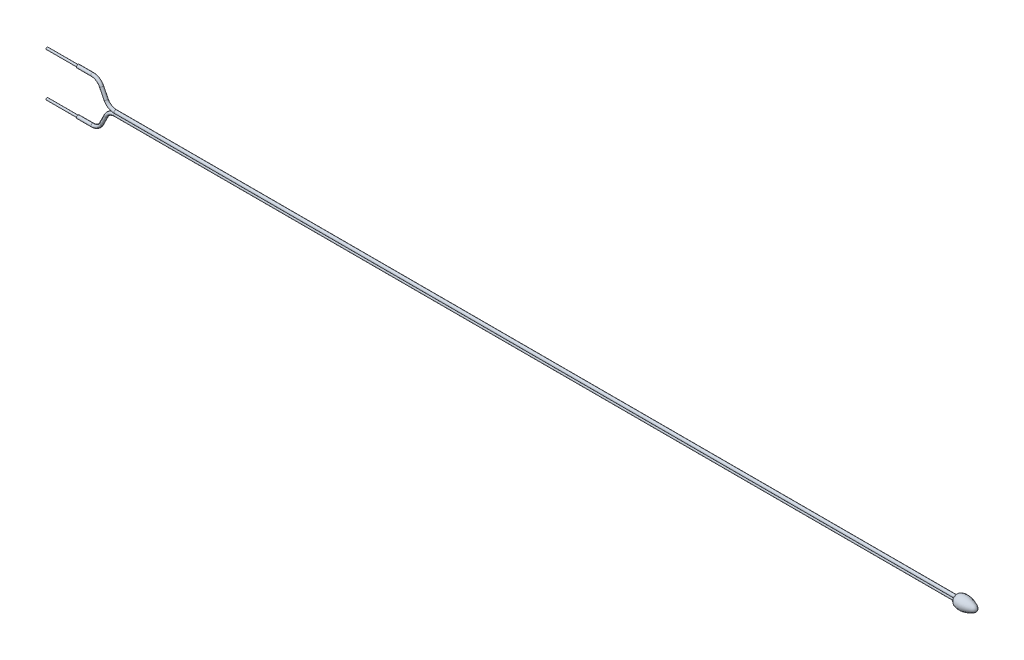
ISO-10303-21;
HEADER;
FILE_DESCRIPTION(('STEP AP214'),'2;1');
FILE_NAME('part.step','',(''),(''),'','','');
FILE_SCHEMA(('AUTOMOTIVE_DESIGN { 1 0 10303 214 1 1 1 1 }'));
ENDSEC;
DATA;
#1=APPLICATION_CONTEXT('core data for automotive mechanical design processes');
#2=APPLICATION_PROTOCOL_DEFINITION('international standard','automotive_design',2000,#1);
#3=PRODUCT_CONTEXT('',#1,'mechanical');
#4=PRODUCT('Part','Part','',(#3));
#5=PRODUCT_RELATED_PRODUCT_CATEGORY('part','',(#4));
#6=PRODUCT_DEFINITION_FORMATION('','',#4);
#7=PRODUCT_DEFINITION_CONTEXT('part definition',#1,'design');
#8=PRODUCT_DEFINITION('design','',#6,#7);
#9=PRODUCT_DEFINITION_SHAPE('','',#8);
#10=(LENGTH_UNIT() NAMED_UNIT(*) SI_UNIT(.MILLI.,.METRE.));
#11=(NAMED_UNIT(*) PLANE_ANGLE_UNIT() SI_UNIT($,.RADIAN.));
#12=(NAMED_UNIT(*) SI_UNIT($,.STERADIAN.) SOLID_ANGLE_UNIT());
#13=UNCERTAINTY_MEASURE_WITH_UNIT(LENGTH_MEASURE(1.E-05),#10,'distance_accuracy_value','');
#14=(GEOMETRIC_REPRESENTATION_CONTEXT(3) GLOBAL_UNCERTAINTY_ASSIGNED_CONTEXT((#13)) GLOBAL_UNIT_ASSIGNED_CONTEXT((#10,
#11,#12)) REPRESENTATION_CONTEXT('',''));
#15=CARTESIAN_POINT('',(0.,0.,0.));
#16=DIRECTION('',(0.,0.,1.));
#17=DIRECTION('',(1.,0.,0.));
#18=AXIS2_PLACEMENT_3D('',#15,#16,#17);
#19=CARTESIAN_POINT('',(-83.6180339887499,-2.11999999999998,0.));
#20=DIRECTION('',(-1.,0.,0.));
#21=DIRECTION('',(0.,-1.,0.));
#22=AXIS2_PLACEMENT_3D('',#19,#20,#21);
#23=CYLINDRICAL_SURFACE('',#22,0.15);
#24=CARTESIAN_POINT('',(-83.6180339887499,-2.11999999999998,0.));
#25=DIRECTION('',(1.,0.,0.));
#26=DIRECTION('',(0.,0.,1.));
#27=AXIS2_PLACEMENT_3D('',#24,#25,#26);
#28=CIRCLE('',#27,0.15);
#29=CARTESIAN_POINT('',(-83.6180339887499,-2.26999999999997,0.));
#30=VERTEX_POINT('',#29);
#31=EDGE_CURVE('E82',#30,#30,#28,.F.);
#32=ORIENTED_EDGE('',*,*,#31,.T.);
#33=EDGE_LOOP('',(#32));
#34=FACE_BOUND('',#33,.T.);
#35=CARTESIAN_POINT('',(-85.,-2.11999999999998,0.));
#36=DIRECTION('',(-1.,0.,0.));
#37=DIRECTION('',(0.,0.,1.));
#38=AXIS2_PLACEMENT_3D('',#35,#36,#37);
#39=CIRCLE('',#38,0.15);
#40=CARTESIAN_POINT('',(-85.,-2.11999999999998,0.15));
#41=VERTEX_POINT('',#40);
#42=EDGE_CURVE('E42',#41,#41,#39,.F.);
#43=ORIENTED_EDGE('',*,*,#42,.T.);
#44=EDGE_LOOP('',(#43));
#45=FACE_BOUND('',#44,.T.);
#46=ADVANCED_FACE('F37',(#34,#45),#23,.T.);
#47=CARTESIAN_POINT('',(-83.6180339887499,2.11999999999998,0.));
#48=DIRECTION('',(-1.,0.,0.));
#49=DIRECTION('',(0.,-1.,0.));
#50=AXIS2_PLACEMENT_3D('',#47,#48,#49);
#51=CYLINDRICAL_SURFACE('',#50,0.15);
#52=CARTESIAN_POINT('',(-83.6180339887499,2.11999999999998,0.));
#53=DIRECTION('',(-1.,0.,0.));
#54=DIRECTION('',(0.,0.,1.));
#55=AXIS2_PLACEMENT_3D('',#52,#53,#54);
#56=CIRCLE('',#55,0.15);
#57=CARTESIAN_POINT('',(-83.6180339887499,2.26999999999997,0.));
#58=VERTEX_POINT('',#57);
#59=EDGE_CURVE('E115',#58,#58,#56,.T.);
#60=ORIENTED_EDGE('',*,*,#59,.T.);
#61=EDGE_LOOP('',(#60));
#62=FACE_BOUND('',#61,.T.);
#63=CARTESIAN_POINT('',(-85.,2.11999999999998,0.));
#64=DIRECTION('',(-1.,0.,0.));
#65=DIRECTION('',(0.,0.,1.));
#66=AXIS2_PLACEMENT_3D('',#63,#64,#65);
#67=CIRCLE('',#66,0.15);
#68=CARTESIAN_POINT('',(-85.,2.11999999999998,0.15));
#69=VERTEX_POINT('',#68);
#70=EDGE_CURVE('E75',#69,#69,#67,.F.);
#71=ORIENTED_EDGE('',*,*,#70,.T.);
#72=EDGE_LOOP('',(#71));
#73=FACE_BOUND('',#72,.T.);
#74=ADVANCED_FACE('F154',(#62,#73),#51,.T.);
#75=CARTESIAN_POINT('',(2.,0.,0.));
#76=CARTESIAN_POINT('',(1.98555284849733,0.226242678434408,0.));
#77=CARTESIAN_POINT('',(1.44706791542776,0.470950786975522,0.));
#78=CARTESIAN_POINT('',(0.767947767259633,0.661200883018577,0.));
#79=CARTESIAN_POINT('',(0.11509678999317,0.55180024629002,0.));
#80=CARTESIAN_POINT('',(0.,0.3,0.));
#81=B_SPLINE_CURVE_WITH_KNOTS('',3,(#75,#76,#77,#78,#79,#80),.UNSPECIFIED.,.F.,.F.,(4,1,1,4),
(0.,0.27710911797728,0.65585589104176,1.),.UNSPECIFIED.);
#82=CARTESIAN_POINT('',(0.,0.,0.));
#83=DIRECTION('',(-1.,0.,0.));
#84=AXIS1_PLACEMENT('',#82,#83);
#85=SURFACE_OF_REVOLUTION('',#81,#84);
#86=CARTESIAN_POINT('',(0.,0.,0.));
#87=DIRECTION('',(-1.,0.,0.));
#88=DIRECTION('',(0.,0.,1.));
#89=AXIS2_PLACEMENT_3D('',#86,#87,#88);
#90=CIRCLE('',#89,0.3);
#91=CARTESIAN_POINT('',(0.,0.,0.3));
#92=VERTEX_POINT('',#91);
#93=EDGE_CURVE('E108',#92,#92,#90,.T.);
#94=ORIENTED_EDGE('',*,*,#93,.F.);
#95=EDGE_LOOP('',(#94));
#96=FACE_BOUND('',#95,.T.);
#97=CARTESIAN_POINT('',(2.,0.,0.));
#98=VERTEX_POINT('',#97);
#99=VERTEX_LOOP('',#98);
#100=FACE_BOUND('',#99,.T.);
#101=ADVANCED_FACE('F39',(#96,#100),#85,.T.);
#102=CARTESIAN_POINT('',(0.,0.,0.));
#103=DIRECTION('',(1.,0.,0.));
#104=DIRECTION('',(0.,0.,-1.));
#105=AXIS2_PLACEMENT_3D('',#102,#103,#104);
#106=PLANE('',#105);
#107=CARTESIAN_POINT('',(0.,0.11999999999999,0.));
#108=DIRECTION('',(-1.,0.,0.));
#109=DIRECTION('',(0.,0.,1.));
#110=AXIS2_PLACEMENT_3D('',#107,#108,#109);
#111=CIRCLE('',#110,0.15);
#112=CARTESIAN_POINT('',(0.,0.,0.0900000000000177));
#113=VERTEX_POINT('',#112);
#114=CARTESIAN_POINT('',(0.,0.,-0.0900000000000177));
#115=VERTEX_POINT('',#114);
#116=EDGE_CURVE('E47',#113,#115,#111,.T.);
#117=ORIENTED_EDGE('',*,*,#116,.F.);
#118=CARTESIAN_POINT('',(0.,-0.11999999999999,0.));
#119=DIRECTION('',(1.,0.,0.));
#120=DIRECTION('',(0.,0.,1.));
#121=AXIS2_PLACEMENT_3D('',#118,#119,#120);
#122=CIRCLE('',#121,0.15);
#123=EDGE_CURVE('E60',#115,#113,#122,.F.);
#124=ORIENTED_EDGE('',*,*,#123,.F.);
#125=EDGE_LOOP('',(#117,#124));
#126=FACE_BOUND('',#125,.T.);
#127=ORIENTED_EDGE('',*,*,#93,.T.);
#128=EDGE_LOOP('',(#127));
#129=FACE_BOUND('',#128,.T.);
#130=ADVANCED_FACE('F170',(#126,#129),#106,.F.);
#131=CARTESIAN_POINT('',(0.,0.11999999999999,0.));
#132=DIRECTION('',(-1.,0.,0.));
#133=DIRECTION('',(0.,-1.,0.));
#134=AXIS2_PLACEMENT_3D('',#131,#132,#133);
#135=CYLINDRICAL_SURFACE('',#134,0.15);
#136=DIRECTION('',(-1.,0.,0.));
#137=VECTOR('',#136,1.);
#138=CARTESIAN_POINT('',(-40.690983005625,0.,0.0900000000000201));
#139=LINE('',#138,#137);
#140=CARTESIAN_POINT('',(-81.3819660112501,0.,0.0900000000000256));
#141=VERTEX_POINT('',#140);
#142=EDGE_CURVE('E54',#113,#141,#139,.T.);
#143=ORIENTED_EDGE('',*,*,#142,.F.);
#144=ORIENTED_EDGE('',*,*,#116,.T.);
#145=DIRECTION('',(-1.,0.,0.));
#146=VECTOR('',#145,1.);
#147=CARTESIAN_POINT('',(-40.690983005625,0.,-0.0900000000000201));
#148=LINE('',#147,#146);
#149=CARTESIAN_POINT('',(-81.3819660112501,0.,-0.0900000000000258));
#150=VERTEX_POINT('',#149);
#151=EDGE_CURVE('E78',#150,#115,#148,.F.);
#152=ORIENTED_EDGE('',*,*,#151,.F.);
#153=CARTESIAN_POINT('',(-81.3819660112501,0.11999999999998,0.));
#154=DIRECTION('',(-1.,0.,0.));
#155=DIRECTION('',(0.,0.,1.));
#156=AXIS2_PLACEMENT_3D('',#153,#154,#155);
#157=CIRCLE('',#156,0.15);
#158=EDGE_CURVE('E70',#141,#150,#157,.T.);
#159=ORIENTED_EDGE('',*,*,#158,.F.);
#160=EDGE_LOOP('',(#143,#144,#152,#159));
#161=FACE_BOUND('',#160,.T.);
#162=ADVANCED_FACE('F79',(#161),#135,.T.);
#163=CARTESIAN_POINT('',(-81.3819660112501,1.11999999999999,0.));
#164=DIRECTION('',(0.,0.,-1.));
#165=DIRECTION('',(-1.,0.,0.));
#166=AXIS2_PLACEMENT_3D('',#163,#164,#165);
#167=TOROIDAL_SURFACE('',#166,1.00000000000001,0.15);
#168=CARTESIAN_POINT('',(-81.3817660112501,0.,0.0899999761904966));
#169=CARTESIAN_POINT('',(-81.3941999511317,0.,0.0899946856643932));
#170=CARTESIAN_POINT('',(-81.4066367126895,0.,0.0897292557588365));
#171=CARTESIAN_POINT('',(-81.4315179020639,0.,0.0886198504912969));
#172=CARTESIAN_POINT('',(-81.4439622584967,0.,0.0877743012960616));
#173=CARTESIAN_POINT('',(-81.4692420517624,0.,0.0854036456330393));
#174=CARTESIAN_POINT('',(-81.4820753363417,0.,0.0838550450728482));
#175=CARTESIAN_POINT('',(-81.507604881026,0.,0.0799277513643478));
#176=CARTESIAN_POINT('',(-81.5203012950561,0.,0.0775501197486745));
#177=CARTESIAN_POINT('',(-81.5452942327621,0.,0.0717308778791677));
#178=CARTESIAN_POINT('',(-81.5575936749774,0.,0.0683018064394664));
#179=CARTESIAN_POINT('',(-81.5816386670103,0.,0.0599109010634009));
#180=CARTESIAN_POINT('',(-81.5933874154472,0.,0.054959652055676));
#181=CARTESIAN_POINT('',(-81.6089976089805,0.,0.0460866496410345));
#182=CARTESIAN_POINT('',(-81.6134635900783,0.,0.0432479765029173));
#183=CARTESIAN_POINT('',(-81.6219376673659,0.,0.0369596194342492));
#184=CARTESIAN_POINT('',(-81.6259479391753,0.,0.033513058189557));
#185=CARTESIAN_POINT('',(-81.6312473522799,0.,0.0278418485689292));
#186=CARTESIAN_POINT('',(-81.6328613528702,0.,0.0259230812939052));
#187=CARTESIAN_POINT('',(-81.6358262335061,0.,0.0218860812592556));
#188=CARTESIAN_POINT('',(-81.6371769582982,0.,0.0197677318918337));
#189=CARTESIAN_POINT('',(-81.6395336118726,0.,0.0153035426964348));
#190=CARTESIAN_POINT('',(-81.6405343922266,0.,0.0129549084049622));
#191=CARTESIAN_POINT('',(-81.6420455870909,0.,0.00810601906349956));
#192=CARTESIAN_POINT('',(-81.6425573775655,0.,0.00560621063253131));
#193=CARTESIAN_POINT('',(-81.6429831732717,0.,0.000909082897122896));
#194=CARTESIAN_POINT('',(-81.6429708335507,0.,-0.00128159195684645));
#195=CARTESIAN_POINT('',(-81.6425305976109,0.,-0.00562124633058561));
#196=CARTESIAN_POINT('',(-81.6421023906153,0.,-0.00777019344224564));
#197=CARTESIAN_POINT('',(-81.6408142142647,0.,-0.0121834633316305));
#198=CARTESIAN_POINT('',(-81.6399128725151,0.,-0.0144354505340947));
#199=CARTESIAN_POINT('',(-81.6377580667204,0.,-0.0187629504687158));
#200=CARTESIAN_POINT('',(-81.6365040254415,0.,-0.0208381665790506));
#201=CARTESIAN_POINT('',(-81.6329547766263,0.,-0.0259226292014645));
#202=CARTESIAN_POINT('',(-81.6304711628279,0.,-0.0287989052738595));
#203=CARTESIAN_POINT('',(-81.6251105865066,0.,-0.0341535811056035));
#204=CARTESIAN_POINT('',(-81.6222326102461,0.,-0.036630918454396));
#205=CARTESIAN_POINT('',(-81.6132343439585,0.,-0.0435719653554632));
#206=CARTESIAN_POINT('',(-81.6067447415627,0.,-0.0475505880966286));
#207=CARTESIAN_POINT('',(-81.5933112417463,0.,-0.0546324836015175));
#208=CARTESIAN_POINT('',(-81.5863658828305,0.,-0.0577327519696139));
#209=CARTESIAN_POINT('',(-81.5682845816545,0.,-0.0648522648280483));
#210=CARTESIAN_POINT('',(-81.5569721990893,0.,-0.0684194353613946));
#211=CARTESIAN_POINT('',(-81.5340664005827,0.,-0.0745207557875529));
#212=CARTESIAN_POINT('',(-81.5224724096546,0.,-0.077052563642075));
#213=CARTESIAN_POINT('',(-81.4874155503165,0.,-0.0835074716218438));
#214=CARTESIAN_POINT('',(-81.4637371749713,0.,-0.0862708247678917));
#215=CARTESIAN_POINT('',(-81.4302792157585,0.,-0.0886531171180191));
#216=CARTESIAN_POINT('',(-81.4205405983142,0.,-0.0891653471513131));
#217=CARTESIAN_POINT('',(-81.4011245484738,0.,-0.0898385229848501));
#218=CARTESIAN_POINT('',(-81.3914472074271,0.,-0.0900020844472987));
#219=CARTESIAN_POINT('',(-81.3817660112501,0.,-0.0899999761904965));
#220=B_SPLINE_CURVE_WITH_KNOTS('',3,(#168,#169,#170,#171,#172,#173,#174,#175,#176,#177,#178,
#179,#180,#181,#182,#183,#184,#185,#186,#187,#188,#189,#190,#191,#192,#193,#194,#195,#196,#197,
#198,#199,#200,#201,#202,#203,#204,#205,#206,#207,#208,#209,#210,#211,#212,#213,#214,#215,#216,
#217,#218,#219),.UNSPECIFIED.,.F.,.F.,(4,2,2,2,2,2,2,2,2,2,2,2,2,2,2,2,2,2,2,2,2,2,2,2,2,4),(0.,
0.0373034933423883,0.0747085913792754,0.113467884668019,0.15217772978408,0.190442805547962,
0.228447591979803,0.244292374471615,0.260058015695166,0.26756364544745,0.275073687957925,
0.282689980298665,0.290284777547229,0.296816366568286,0.303352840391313,0.310590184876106,
0.317839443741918,0.329175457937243,0.340541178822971,0.363250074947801,0.386035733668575,
0.421531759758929,0.457107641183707,0.528445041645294,0.557699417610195,0.586733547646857),.UNSPECIFIED.);
#221=EDGE_CURVE('E11',#141,#150,#220,.T.);
#222=ORIENTED_EDGE('',*,*,#221,.F.);
#223=ORIENTED_EDGE('',*,*,#158,.T.);
#224=EDGE_LOOP('',(#222,#223));
#225=FACE_BOUND('',#224,.T.);
#226=CARTESIAN_POINT('',(-82.27639320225,0.672786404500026,0.));
#227=DIRECTION('',(-0.44721359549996,0.894427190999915,0.));
#228=DIRECTION('',(0.,0.,1.));
#229=AXIS2_PLACEMENT_3D('',#226,#227,#228);
#230=CIRCLE('',#229,0.15);
#231=CARTESIAN_POINT('',(-82.27639320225,0.672786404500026,0.15));
#232=VERTEX_POINT('',#231);
#233=EDGE_CURVE('E74',#232,#232,#230,.T.);
#234=ORIENTED_EDGE('',*,*,#233,.F.);
#235=EDGE_LOOP('',(#234));
#236=FACE_BOUND('',#235,.T.);
#237=ADVANCED_FACE('F72',(#225,#236),#167,.T.);
#238=CARTESIAN_POINT('',(-82.27639320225,0.672786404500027,0.));
#239=DIRECTION('',(-0.447213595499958,0.894427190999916,0.));
#240=DIRECTION('',(-0.894427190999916,-0.447213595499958,0.));
#241=AXIS2_PLACEMENT_3D('',#238,#239,#240);
#242=CYLINDRICAL_SURFACE('',#241,0.15);
#243=CARTESIAN_POINT('',(-82.72360679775,1.56721359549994,0.));
#244=DIRECTION('',(-0.447213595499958,0.894427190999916,0.));
#245=DIRECTION('',(0.,0.,1.));
#246=AXIS2_PLACEMENT_3D('',#243,#244,#245);
#247=CIRCLE('',#246,0.15);
#248=CARTESIAN_POINT('',(-82.5894427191,1.63429563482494,0.));
#249=VERTEX_POINT('',#248);
#250=EDGE_CURVE('E112',#249,#249,#247,.T.);
#251=ORIENTED_EDGE('',*,*,#250,.F.);
#252=EDGE_LOOP('',(#251));
#253=FACE_BOUND('',#252,.T.);
#254=ORIENTED_EDGE('',*,*,#233,.T.);
#255=EDGE_LOOP('',(#254));
#256=FACE_BOUND('',#255,.T.);
#257=ADVANCED_FACE('F175',(#253,#256),#242,.T.);
#258=CARTESIAN_POINT('',(-83.6180339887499,1.11999999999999,0.));
#259=DIRECTION('',(0.,0.,1.));
#260=DIRECTION('',(1.,0.,0.));
#261=AXIS2_PLACEMENT_3D('',#258,#259,#260);
#262=TOROIDAL_SURFACE('',#261,0.999999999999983,0.15);
#263=CARTESIAN_POINT('',(-83.6180339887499,1.11999999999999,0.));
#264=DIRECTION('',(0.,0.,1.));
#265=DIRECTION('',(1.,0.,0.));
#266=AXIS2_PLACEMENT_3D('',#263,#264,#265);
#267=CIRCLE('',#266,1.14999999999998);
#268=EDGE_CURVE('',#249,#58,#267,.T.);
#269=ORIENTED_EDGE('',*,*,#250,.T.);
#270=ORIENTED_EDGE('',*,*,#59,.F.);
#271=ORIENTED_EDGE('',*,*,#268,.T.);
#272=ORIENTED_EDGE('',*,*,#268,.F.);
#273=EDGE_LOOP('',(#269,#271,#270,#272));
#274=FACE_BOUND('',#273,.T.);
#275=ADVANCED_FACE('F167',(#274),#262,.T.);
#276=CARTESIAN_POINT('',(-85.,2.11999999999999,0.));
#277=DIRECTION('',(-1.,0.,0.));
#278=DIRECTION('',(0.,0.,1.));
#279=AXIS2_PLACEMENT_3D('',#276,#277,#278);
#280=PLANE('',#279);
#281=ORIENTED_EDGE('',*,*,#70,.F.);
#282=EDGE_LOOP('',(#281));
#283=FACE_BOUND('',#282,.T.);
#284=CARTESIAN_POINT('',(-85.,2.11999999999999,0.));
#285=DIRECTION('',(-1.,0.,0.));
#286=DIRECTION('',(0.,0.,1.));
#287=AXIS2_PLACEMENT_3D('',#284,#285,#286);
#288=CIRCLE('',#287,0.0999999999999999);
#289=CARTESIAN_POINT('',(-85.,2.11999999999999,0.0999999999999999));
#290=VERTEX_POINT('',#289);
#291=EDGE_CURVE('E103',#290,#290,#288,.T.);
#292=ORIENTED_EDGE('',*,*,#291,.F.);
#293=EDGE_LOOP('',(#292));
#294=FACE_BOUND('',#293,.T.);
#295=ADVANCED_FACE('F164',(#283,#294),#280,.T.);
#296=CARTESIAN_POINT('',(-85.,2.11999999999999,0.));
#297=DIRECTION('',(-1.,0.,0.));
#298=DIRECTION('',(0.,0.,1.));
#299=AXIS2_PLACEMENT_3D('',#296,#297,#298);
#300=CYLINDRICAL_SURFACE('',#299,0.0999999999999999);
#301=ORIENTED_EDGE('',*,*,#291,.T.);
#302=EDGE_LOOP('',(#301));
#303=FACE_BOUND('',#302,.T.);
#304=CARTESIAN_POINT('',(-88.,2.11999999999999,0.));
#305=DIRECTION('',(-1.,0.,0.));
#306=DIRECTION('',(0.,0.,1.));
#307=AXIS2_PLACEMENT_3D('',#304,#305,#306);
#308=CIRCLE('',#307,0.0999999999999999);
#309=CARTESIAN_POINT('',(-88.,2.11999999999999,0.0999999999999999));
#310=VERTEX_POINT('',#309);
#311=EDGE_CURVE('E102',#310,#310,#308,.T.);
#312=ORIENTED_EDGE('',*,*,#311,.F.);
#313=EDGE_LOOP('',(#312));
#314=FACE_BOUND('',#313,.T.);
#315=ADVANCED_FACE('F161',(#303,#314),#300,.T.);
#316=CARTESIAN_POINT('',(-88.,2.11999999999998,0.));
#317=DIRECTION('',(-1.,0.,0.));
#318=DIRECTION('',(0.,0.,1.));
#319=AXIS2_PLACEMENT_3D('',#316,#317,#318);
#320=PLANE('',#319);
#321=ORIENTED_EDGE('',*,*,#311,.T.);
#322=EDGE_LOOP('',(#321));
#323=FACE_BOUND('',#322,.T.);
#324=ADVANCED_FACE('F151',(#323),#320,.T.);
#325=CARTESIAN_POINT('',(0.,-0.11999999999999,0.));
#326=DIRECTION('',(-1.,0.,0.));
#327=DIRECTION('',(0.,-1.,0.));
#328=AXIS2_PLACEMENT_3D('',#325,#326,#327);
#329=CYLINDRICAL_SURFACE('',#328,0.15);
#330=ORIENTED_EDGE('',*,*,#123,.T.);
#331=ORIENTED_EDGE('',*,*,#142,.T.);
#332=CARTESIAN_POINT('',(-81.3819660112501,-0.11999999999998,0.));
#333=DIRECTION('',(1.,0.,0.));
#334=DIRECTION('',(0.,0.,1.));
#335=AXIS2_PLACEMENT_3D('',#332,#333,#334);
#336=CIRCLE('',#335,0.15);
#337=EDGE_CURVE('E87',#150,#141,#336,.F.);
#338=ORIENTED_EDGE('',*,*,#337,.F.);
#339=ORIENTED_EDGE('',*,*,#151,.T.);
#340=EDGE_LOOP('',(#330,#331,#338,#339));
#341=FACE_BOUND('',#340,.T.);
#342=ADVANCED_FACE('F88',(#341),#329,.T.);
#343=CARTESIAN_POINT('',(-81.3819660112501,-1.11999999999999,0.));
#344=DIRECTION('',(0.,0.,1.));
#345=DIRECTION('',(1.,0.,0.));
#346=AXIS2_PLACEMENT_3D('',#343,#344,#345);
#347=TOROIDAL_SURFACE('',#346,1.00000000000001,0.15);
#348=CARTESIAN_POINT('',(-82.27639320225,-0.672786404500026,0.));
#349=DIRECTION('',(0.44721359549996,0.894427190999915,0.));
#350=DIRECTION('',(0.,0.,1.));
#351=AXIS2_PLACEMENT_3D('',#348,#349,#350);
#352=CIRCLE('',#351,0.15);
#353=CARTESIAN_POINT('',(-82.27639320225,-0.672786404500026,0.15));
#354=VERTEX_POINT('',#353);
#355=EDGE_CURVE('E89',#354,#354,#352,.F.);
#356=ORIENTED_EDGE('',*,*,#355,.F.);
#357=EDGE_LOOP('',(#356));
#358=FACE_BOUND('',#357,.T.);
#359=ORIENTED_EDGE('',*,*,#337,.T.);
#360=ORIENTED_EDGE('',*,*,#221,.T.);
#361=EDGE_LOOP('',(#359,#360));
#362=FACE_BOUND('',#361,.T.);
#363=ADVANCED_FACE('F86',(#358,#362),#347,.T.);
#364=CARTESIAN_POINT('',(-82.27639320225,-0.672786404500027,0.));
#365=DIRECTION('',(-0.447213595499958,-0.894427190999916,0.));
#366=DIRECTION('',(0.894427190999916,-0.447213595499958,0.));
#367=AXIS2_PLACEMENT_3D('',#364,#365,#366);
#368=CYLINDRICAL_SURFACE('',#367,0.15);
#369=CARTESIAN_POINT('',(-82.72360679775,-1.56721359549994,0.));
#370=DIRECTION('',(0.447213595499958,0.894427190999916,0.));
#371=DIRECTION('',(0.,0.,1.));
#372=AXIS2_PLACEMENT_3D('',#369,#370,#371);
#373=CIRCLE('',#372,0.15);
#374=CARTESIAN_POINT('',(-82.5894427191,-1.63429563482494,0.));
#375=VERTEX_POINT('',#374);
#376=EDGE_CURVE('E92',#375,#375,#373,.F.);
#377=ORIENTED_EDGE('',*,*,#376,.F.);
#378=EDGE_LOOP('',(#377));
#379=FACE_BOUND('',#378,.T.);
#380=ORIENTED_EDGE('',*,*,#355,.T.);
#381=EDGE_LOOP('',(#380));
#382=FACE_BOUND('',#381,.T.);
#383=ADVANCED_FACE('F140',(#379,#382),#368,.T.);
#384=CARTESIAN_POINT('',(-83.6180339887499,-1.11999999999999,0.));
#385=DIRECTION('',(0.,0.,-1.));
#386=DIRECTION('',(-1.,0.,0.));
#387=AXIS2_PLACEMENT_3D('',#384,#385,#386);
#388=TOROIDAL_SURFACE('',#387,0.999999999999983,0.15);
#389=CARTESIAN_POINT('',(-83.6180339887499,-1.11999999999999,0.));
#390=DIRECTION('',(0.,0.,-1.));
#391=DIRECTION('',(-1.,0.,0.));
#392=AXIS2_PLACEMENT_3D('',#389,#390,#391);
#393=CIRCLE('',#392,1.14999999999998);
#394=EDGE_CURVE('',#375,#30,#393,.T.);
#395=ORIENTED_EDGE('',*,*,#376,.T.);
#396=ORIENTED_EDGE('',*,*,#31,.F.);
#397=ORIENTED_EDGE('',*,*,#394,.T.);
#398=ORIENTED_EDGE('',*,*,#394,.F.);
#399=EDGE_LOOP('',(#395,#397,#396,#398));
#400=FACE_BOUND('',#399,.T.);
#401=ADVANCED_FACE('F145',(#400),#388,.T.);
#402=CARTESIAN_POINT('',(-85.,-2.11999999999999,0.));
#403=DIRECTION('',(-1.,0.,0.));
#404=DIRECTION('',(0.,0.,1.));
#405=AXIS2_PLACEMENT_3D('',#402,#403,#404);
#406=PLANE('',#405);
#407=ORIENTED_EDGE('',*,*,#42,.F.);
#408=EDGE_LOOP('',(#407));
#409=FACE_BOUND('',#408,.T.);
#410=CARTESIAN_POINT('',(-85.,-2.11999999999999,0.));
#411=DIRECTION('',(1.,0.,0.));
#412=DIRECTION('',(0.,0.,1.));
#413=AXIS2_PLACEMENT_3D('',#410,#411,#412);
#414=CIRCLE('',#413,0.0999999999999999);
#415=CARTESIAN_POINT('',(-85.,-2.11999999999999,0.0999999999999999));
#416=VERTEX_POINT('',#415);
#417=EDGE_CURVE('E215',#416,#416,#414,.T.);
#418=ORIENTED_EDGE('',*,*,#417,.T.);
#419=EDGE_LOOP('',(#418));
#420=FACE_BOUND('',#419,.T.);
#421=ADVANCED_FACE('F149',(#409,#420),#406,.T.);
#422=CARTESIAN_POINT('',(-85.,-2.11999999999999,0.));
#423=DIRECTION('',(-1.,0.,0.));
#424=DIRECTION('',(0.,0.,1.));
#425=AXIS2_PLACEMENT_3D('',#422,#423,#424);
#426=CYLINDRICAL_SURFACE('',#425,0.0999999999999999);
#427=ORIENTED_EDGE('',*,*,#417,.F.);
#428=EDGE_LOOP('',(#427));
#429=FACE_BOUND('',#428,.T.);
#430=CARTESIAN_POINT('',(-88.,-2.11999999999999,0.));
#431=DIRECTION('',(1.,0.,0.));
#432=DIRECTION('',(0.,0.,1.));
#433=AXIS2_PLACEMENT_3D('',#430,#431,#432);
#434=CIRCLE('',#433,0.0999999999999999);
#435=CARTESIAN_POINT('',(-88.,-2.11999999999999,0.0999999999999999));
#436=VERTEX_POINT('',#435);
#437=EDGE_CURVE('E216',#436,#436,#434,.T.);
#438=ORIENTED_EDGE('',*,*,#437,.T.);
#439=EDGE_LOOP('',(#438));
#440=FACE_BOUND('',#439,.T.);
#441=ADVANCED_FACE('F159',(#429,#440),#426,.T.);
#442=CARTESIAN_POINT('',(-88.,-2.11999999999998,0.));
#443=DIRECTION('',(-1.,0.,0.));
#444=DIRECTION('',(0.,0.,1.));
#445=AXIS2_PLACEMENT_3D('',#442,#443,#444);
#446=PLANE('',#445);
#447=ORIENTED_EDGE('',*,*,#437,.F.);
#448=EDGE_LOOP('',(#447));
#449=FACE_BOUND('',#448,.T.);
#450=ADVANCED_FACE('F156',(#449),#446,.T.);
#451=CLOSED_SHELL('',(#46,#74,#101,#130,#162,#237,#257,#275,#295,#315,#324,#342,#363,#383,#401,
#421,#441,#450));
#452=MANIFOLD_SOLID_BREP('B2',#451);
#453=ADVANCED_BREP_SHAPE_REPRESENTATION('',(#18,#452),#14);
#454=SHAPE_DEFINITION_REPRESENTATION(#9,#453);
ENDSEC;
END-ISO-10303-21;
